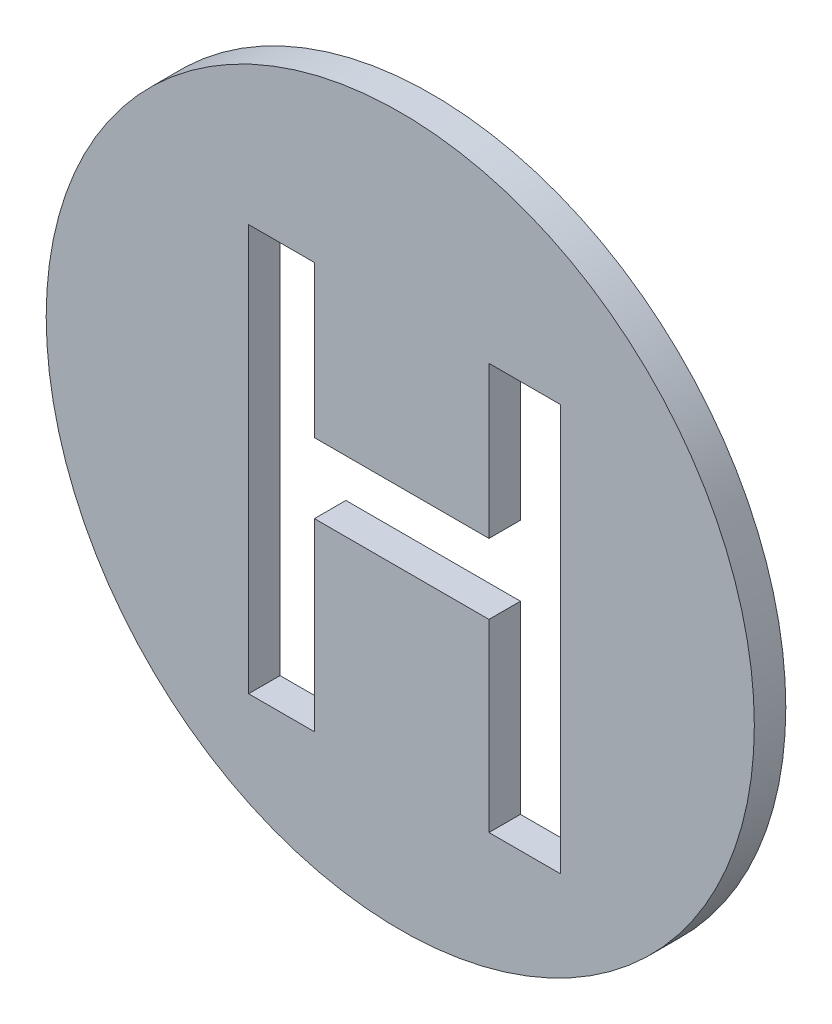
from build123d import *

# Parameters (mm, degrees)
SKETCH1_R           = 45
BOSS_EXTRUDE1_DEPTH = 4
CUT_EXTRUDE1_DEPTH  = 4


with BuildPart() as part:
    # Sketch1 → Boss-Extrude1 (new body)
    with BuildSketch(Plane.XY):
        Circle(SKETCH1_R)
    extrude(amount=BOSS_EXTRUDE1_DEPTH)

    # Sketch2 → Cut-Extrude1 (cut)
    with BuildSketch(Plane.XY.offset(4)):
        Polygon((-19.275477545, 23.003282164), (-19.275477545, -28.640450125), (-10.910647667, -28.640450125), (-10.910647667, -5.182557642), (11.274335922, -5.182557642), (11.274335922, -28.640450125), (20.366542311, -28.640450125), (20.366542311, 23.003282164), (11.274335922, 23.003282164), (11.274335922, 3.727804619), (-10.910647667, 3.727804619), (-10.910647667, 23.003282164), align=None)
    extrude(amount=-CUT_EXTRUDE1_DEPTH, mode=Mode.SUBTRACT)


solid = part.part
